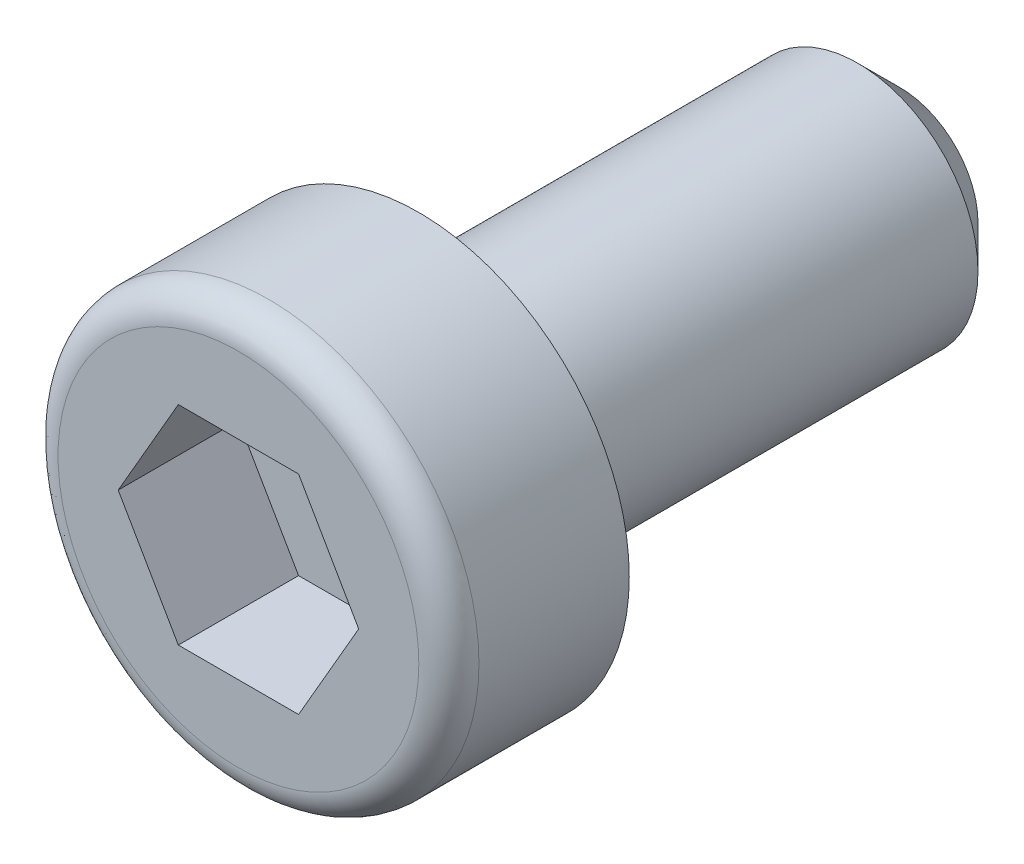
ISO-10303-21;
HEADER;
FILE_DESCRIPTION(('STEP AP214'),'2;1');
FILE_NAME('part.step','',(''),(''),'','','');
FILE_SCHEMA(('AUTOMOTIVE_DESIGN { 1 0 10303 214 1 1 1 1 }'));
ENDSEC;
DATA;
#1=APPLICATION_CONTEXT('core data for automotive mechanical design processes');
#2=APPLICATION_PROTOCOL_DEFINITION('international standard','automotive_design',2000,#1);
#3=PRODUCT_CONTEXT('',#1,'mechanical');
#4=PRODUCT('Part','Part','',(#3));
#5=PRODUCT_RELATED_PRODUCT_CATEGORY('part','',(#4));
#6=PRODUCT_DEFINITION_FORMATION('','',#4);
#7=PRODUCT_DEFINITION_CONTEXT('part definition',#1,'design');
#8=PRODUCT_DEFINITION('design','',#6,#7);
#9=PRODUCT_DEFINITION_SHAPE('','',#8);
#10=(LENGTH_UNIT() NAMED_UNIT(*) SI_UNIT(.MILLI.,.METRE.));
#11=(NAMED_UNIT(*) PLANE_ANGLE_UNIT() SI_UNIT($,.RADIAN.));
#12=(NAMED_UNIT(*) SI_UNIT($,.STERADIAN.) SOLID_ANGLE_UNIT());
#13=UNCERTAINTY_MEASURE_WITH_UNIT(LENGTH_MEASURE(1.E-05),#10,'distance_accuracy_value','');
#14=(GEOMETRIC_REPRESENTATION_CONTEXT(3) GLOBAL_UNCERTAINTY_ASSIGNED_CONTEXT((#13)) GLOBAL_UNIT_ASSIGNED_CONTEXT((#10,
#11,#12)) REPRESENTATION_CONTEXT('',''));
#15=CARTESIAN_POINT('',(0.,0.,0.));
#16=DIRECTION('',(0.,0.,1.));
#17=DIRECTION('',(1.,0.,0.));
#18=AXIS2_PLACEMENT_3D('',#15,#16,#17);
#19=CARTESIAN_POINT('',(2.,-1.7320508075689,1.));
#20=DIRECTION('',(0.,0.,-1.));
#21=DIRECTION('',(-1.,0.,0.));
#22=AXIS2_PLACEMENT_3D('',#19,#20,#21);
#23=PLANE('',#22);
#24=DIRECTION('',(-0.499999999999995,0.866025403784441,0.));
#25=VECTOR('',#24,1.);
#26=CARTESIAN_POINT('',(1.5,0.86602540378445,1.));
#27=LINE('',#26,#25);
#28=CARTESIAN_POINT('',(1.99999999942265,9.99990360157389E-10,1.));
#29=VERTEX_POINT('',#28);
#30=CARTESIAN_POINT('',(1.,1.73205080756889,1.));
#31=VERTEX_POINT('',#30);
#32=EDGE_CURVE('E76',#29,#31,#27,.T.);
#33=ORIENTED_EDGE('',*,*,#32,.T.);
#34=DIRECTION('',(-1.,0.,0.));
#35=VECTOR('',#34,1.);
#36=CARTESIAN_POINT('',(0.,1.7320508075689,1.));
#37=LINE('',#36,#35);
#38=CARTESIAN_POINT('',(-1.,1.73205080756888,1.));
#39=VERTEX_POINT('',#38);
#40=EDGE_CURVE('E105',#31,#39,#37,.T.);
#41=ORIENTED_EDGE('',*,*,#40,.T.);
#42=DIRECTION('',(-0.499999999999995,-0.866025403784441,0.));
#43=VECTOR('',#42,1.);
#44=CARTESIAN_POINT('',(-1.5,0.86602540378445,1.));
#45=LINE('',#44,#43);
#46=CARTESIAN_POINT('',(-1.99999999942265,-1.00000987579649E-09,1.));
#47=VERTEX_POINT('',#46);
#48=EDGE_CURVE('E59',#39,#47,#45,.T.);
#49=ORIENTED_EDGE('',*,*,#48,.T.);
#50=DIRECTION('',(0.499999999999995,-0.866025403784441,0.));
#51=VECTOR('',#50,1.);
#52=CARTESIAN_POINT('',(-1.5,-0.86602540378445,1.));
#53=LINE('',#52,#51);
#54=CARTESIAN_POINT('',(-1.,-1.7320508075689,1.));
#55=VERTEX_POINT('',#54);
#56=EDGE_CURVE('E100',#47,#55,#53,.T.);
#57=ORIENTED_EDGE('',*,*,#56,.T.);
#58=DIRECTION('',(1.,0.,0.));
#59=VECTOR('',#58,1.);
#60=CARTESIAN_POINT('',(0.,-1.7320508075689,1.));
#61=LINE('',#60,#59);
#62=CARTESIAN_POINT('',(1.,-1.7320508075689,1.));
#63=VERTEX_POINT('',#62);
#64=EDGE_CURVE('E92',#55,#63,#61,.T.);
#65=ORIENTED_EDGE('',*,*,#64,.T.);
#66=DIRECTION('',(0.499999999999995,0.866025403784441,0.));
#67=VECTOR('',#66,1.);
#68=CARTESIAN_POINT('',(1.5,-0.86602540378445,1.));
#69=LINE('',#68,#67);
#70=EDGE_CURVE('E85',#63,#29,#69,.T.);
#71=ORIENTED_EDGE('',*,*,#70,.T.);
#72=EDGE_LOOP('',(#33,#41,#49,#57,#65,#71));
#73=FACE_BOUND('',#72,.T.);
#74=ADVANCED_FACE('F15',(#73),#23,.F.);
#75=CARTESIAN_POINT('',(2.,0.,3.));
#76=DIRECTION('',(0.866025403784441,0.499999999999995,0.));
#77=DIRECTION('',(0.,0.,-1.));
#78=AXIS2_PLACEMENT_3D('',#75,#76,#77);
#79=PLANE('',#78);
#80=DIRECTION('',(0.,0.,-1.));
#81=VECTOR('',#80,1.);
#82=CARTESIAN_POINT('',(1.,1.7320508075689,2.));
#83=LINE('',#82,#81);
#84=CARTESIAN_POINT('',(1.00000000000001,1.73205080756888,3.));
#85=VERTEX_POINT('',#84);
#86=EDGE_CURVE('E53',#85,#31,#83,.T.);
#87=ORIENTED_EDGE('',*,*,#86,.T.);
#88=ORIENTED_EDGE('',*,*,#32,.F.);
#89=DIRECTION('',(0.,0.,1.));
#90=VECTOR('',#89,1.);
#91=CARTESIAN_POINT('',(2.,0.,2.));
#92=LINE('',#91,#90);
#93=CARTESIAN_POINT('',(1.99999999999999,0.,3.));
#94=VERTEX_POINT('',#93);
#95=EDGE_CURVE('E80',#29,#94,#92,.T.);
#96=ORIENTED_EDGE('',*,*,#95,.T.);
#97=DIRECTION('',(0.499999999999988,-0.866025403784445,0.));
#98=VECTOR('',#97,1.);
#99=CARTESIAN_POINT('',(1.00000000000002,1.73205080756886,3.));
#100=LINE('',#99,#98);
#101=EDGE_CURVE('E19',#85,#94,#100,.T.);
#102=ORIENTED_EDGE('',*,*,#101,.F.);
#103=EDGE_LOOP('',(#87,#88,#96,#102));
#104=FACE_BOUND('',#103,.T.);
#105=ADVANCED_FACE('F78',(#104),#79,.F.);
#106=CARTESIAN_POINT('',(1.,-1.7320508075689,3.));
#107=DIRECTION('',(0.866025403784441,-0.499999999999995,0.));
#108=DIRECTION('',(0.,0.,-1.));
#109=AXIS2_PLACEMENT_3D('',#106,#107,#108);
#110=PLANE('',#109);
#111=ORIENTED_EDGE('',*,*,#95,.F.);
#112=ORIENTED_EDGE('',*,*,#70,.F.);
#113=DIRECTION('',(0.,0.,1.));
#114=VECTOR('',#113,1.);
#115=CARTESIAN_POINT('',(1.,-1.7320508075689,2.));
#116=LINE('',#115,#114);
#117=CARTESIAN_POINT('',(1.00000000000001,-1.73205080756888,3.));
#118=VERTEX_POINT('',#117);
#119=EDGE_CURVE('E99',#63,#118,#116,.T.);
#120=ORIENTED_EDGE('',*,*,#119,.T.);
#121=DIRECTION('',(-0.499999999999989,-0.866025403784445,0.));
#122=VECTOR('',#121,1.);
#123=CARTESIAN_POINT('',(1.99999999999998,0.,3.));
#124=LINE('',#123,#122);
#125=EDGE_CURVE('E91',#94,#118,#124,.T.);
#126=ORIENTED_EDGE('',*,*,#125,.F.);
#127=EDGE_LOOP('',(#111,#112,#120,#126));
#128=FACE_BOUND('',#127,.T.);
#129=ADVANCED_FACE('F88',(#128),#110,.F.);
#130=CARTESIAN_POINT('',(-1.,-1.7320508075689,3.));
#131=DIRECTION('',(0.,-1.,0.));
#132=DIRECTION('',(0.,0.,-1.));
#133=AXIS2_PLACEMENT_3D('',#130,#131,#132);
#134=PLANE('',#133);
#135=ORIENTED_EDGE('',*,*,#119,.F.);
#136=ORIENTED_EDGE('',*,*,#64,.F.);
#137=DIRECTION('',(0.,0.,1.));
#138=VECTOR('',#137,1.);
#139=CARTESIAN_POINT('',(-1.,-1.7320508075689,2.));
#140=LINE('',#139,#138);
#141=CARTESIAN_POINT('',(-1.00000000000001,-1.73205080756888,3.));
#142=VERTEX_POINT('',#141);
#143=EDGE_CURVE('E102',#55,#142,#140,.T.);
#144=ORIENTED_EDGE('',*,*,#143,.T.);
#145=DIRECTION('',(-1.,0.,0.));
#146=VECTOR('',#145,1.);
#147=CARTESIAN_POINT('',(0.,-1.73205080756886,3.));
#148=LINE('',#147,#146);
#149=EDGE_CURVE('E204',#118,#142,#148,.T.);
#150=ORIENTED_EDGE('',*,*,#149,.F.);
#151=EDGE_LOOP('',(#135,#136,#144,#150));
#152=FACE_BOUND('',#151,.T.);
#153=ADVANCED_FACE('F185',(#152),#134,.F.);
#154=CARTESIAN_POINT('',(-2.,0.,3.));
#155=DIRECTION('',(-0.866025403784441,-0.499999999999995,0.));
#156=DIRECTION('',(0.,0.,-1.));
#157=AXIS2_PLACEMENT_3D('',#154,#155,#156);
#158=PLANE('',#157);
#159=ORIENTED_EDGE('',*,*,#143,.F.);
#160=ORIENTED_EDGE('',*,*,#56,.F.);
#161=DIRECTION('',(0.,0.,1.));
#162=VECTOR('',#161,1.);
#163=CARTESIAN_POINT('',(-2.,0.,2.));
#164=LINE('',#163,#162);
#165=CARTESIAN_POINT('',(-1.99999999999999,0.,3.));
#166=VERTEX_POINT('',#165);
#167=EDGE_CURVE('E104',#47,#166,#164,.T.);
#168=ORIENTED_EDGE('',*,*,#167,.T.);
#169=DIRECTION('',(-0.499999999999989,0.866025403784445,0.));
#170=VECTOR('',#169,1.);
#171=CARTESIAN_POINT('',(-1.00000000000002,-1.73205080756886,3.));
#172=LINE('',#171,#170);
#173=EDGE_CURVE('E206',#142,#166,#172,.T.);
#174=ORIENTED_EDGE('',*,*,#173,.F.);
#175=EDGE_LOOP('',(#159,#160,#168,#174));
#176=FACE_BOUND('',#175,.T.);
#177=ADVANCED_FACE('F188',(#176),#158,.F.);
#178=CARTESIAN_POINT('',(-1.,1.7320508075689,3.));
#179=DIRECTION('',(-0.866025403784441,0.499999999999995,0.));
#180=DIRECTION('',(0.,0.,-1.));
#181=AXIS2_PLACEMENT_3D('',#178,#179,#180);
#182=PLANE('',#181);
#183=ORIENTED_EDGE('',*,*,#167,.F.);
#184=ORIENTED_EDGE('',*,*,#48,.F.);
#185=DIRECTION('',(0.,0.,1.));
#186=VECTOR('',#185,1.);
#187=CARTESIAN_POINT('',(-1.,1.7320508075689,2.));
#188=LINE('',#187,#186);
#189=CARTESIAN_POINT('',(-1.00000000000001,1.73205080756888,3.));
#190=VERTEX_POINT('',#189);
#191=EDGE_CURVE('E107',#39,#190,#188,.T.);
#192=ORIENTED_EDGE('',*,*,#191,.T.);
#193=DIRECTION('',(0.499999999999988,0.866025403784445,0.));
#194=VECTOR('',#193,1.);
#195=CARTESIAN_POINT('',(-1.99999999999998,0.,3.));
#196=LINE('',#195,#194);
#197=EDGE_CURVE('E34',#166,#190,#196,.T.);
#198=ORIENTED_EDGE('',*,*,#197,.F.);
#199=EDGE_LOOP('',(#183,#184,#192,#198));
#200=FACE_BOUND('',#199,.T.);
#201=ADVANCED_FACE('F191',(#200),#182,.F.);
#202=CARTESIAN_POINT('',(1.,1.7320508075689,3.));
#203=DIRECTION('',(0.,1.,0.));
#204=DIRECTION('',(0.,0.,-1.));
#205=AXIS2_PLACEMENT_3D('',#202,#203,#204);
#206=PLANE('',#205);
#207=ORIENTED_EDGE('',*,*,#191,.F.);
#208=ORIENTED_EDGE('',*,*,#40,.F.);
#209=ORIENTED_EDGE('',*,*,#86,.F.);
#210=DIRECTION('',(1.,0.,0.));
#211=VECTOR('',#210,1.);
#212=CARTESIAN_POINT('',(0.,1.73205080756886,3.));
#213=LINE('',#212,#211);
#214=EDGE_CURVE('E199',#190,#85,#213,.T.);
#215=ORIENTED_EDGE('',*,*,#214,.F.);
#216=EDGE_LOOP('',(#207,#208,#209,#215));
#217=FACE_BOUND('',#216,.T.);
#218=ADVANCED_FACE('F157',(#217),#206,.F.);
#219=CARTESIAN_POINT('',(-3.,-3.,3.));
#220=DIRECTION('',(0.,0.,1.));
#221=DIRECTION('',(1.,0.,0.));
#222=AXIS2_PLACEMENT_3D('',#219,#220,#221);
#223=PLANE('',#222);
#224=ORIENTED_EDGE('',*,*,#197,.T.);
#225=ORIENTED_EDGE('',*,*,#214,.T.);
#226=ORIENTED_EDGE('',*,*,#101,.T.);
#227=ORIENTED_EDGE('',*,*,#125,.T.);
#228=ORIENTED_EDGE('',*,*,#149,.T.);
#229=ORIENTED_EDGE('',*,*,#173,.T.);
#230=EDGE_LOOP('',(#224,#225,#226,#227,#228,#229));
#231=FACE_BOUND('',#230,.T.);
#232=CARTESIAN_POINT('',(0.,0.,3.));
#233=DIRECTION('',(0.,0.,-1.));
#234=DIRECTION('',(1.,0.,0.));
#235=AXIS2_PLACEMENT_3D('',#232,#233,#234);
#236=CIRCLE('',#235,3.);
#237=CARTESIAN_POINT('',(3.,0.,3.));
#238=VERTEX_POINT('',#237);
#239=EDGE_CURVE('E143',#238,#238,#236,.T.);
#240=ORIENTED_EDGE('',*,*,#239,.F.);
#241=EDGE_LOOP('',(#240));
#242=FACE_BOUND('',#241,.T.);
#243=ADVANCED_FACE('F123',(#231,#242),#223,.T.);
#244=CARTESIAN_POINT('',(3.,0.,3.));
#245=CARTESIAN_POINT('',(3.5,0.,3.));
#246=CARTESIAN_POINT('',(3.5,0.,2.5));
#247=CARTESIAN_POINT('',(3.5,0.,2.));
#248=CARTESIAN_POINT('',(3.,0.,2.));
#249=(BOUNDED_CURVE() B_SPLINE_CURVE(2,(#244,#245,#246,#247,#248),.UNSPECIFIED.,.F.,
.F.) B_SPLINE_CURVE_WITH_KNOTS((3,2,3),(0.,0.25,0.5),
.UNSPECIFIED.) CURVE() GEOMETRIC_REPRESENTATION_ITEM() RATIONAL_B_SPLINE_CURVE((1.,
0.70710678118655,1.,0.70710678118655,1.)) REPRESENTATION_ITEM(''));
#250=CARTESIAN_POINT('',(0.,0.,2.));
#251=DIRECTION('',(0.,0.,1.));
#252=AXIS1_PLACEMENT('',#250,#251);
#253=SURFACE_OF_REVOLUTION('',#249,#252);
#254=CARTESIAN_POINT('',(0.,0.,2.5));
#255=DIRECTION('',(0.,0.,1.));
#256=DIRECTION('',(1.,0.,0.));
#257=AXIS2_PLACEMENT_3D('',#254,#255,#256);
#258=CIRCLE('',#257,3.5);
#259=CARTESIAN_POINT('',(3.5,0.,2.5));
#260=VERTEX_POINT('',#259);
#261=EDGE_CURVE('E217',#260,#260,#258,.T.);
#262=ORIENTED_EDGE('',*,*,#261,.T.);
#263=EDGE_LOOP('',(#262));
#264=FACE_BOUND('',#263,.T.);
#265=ORIENTED_EDGE('',*,*,#239,.T.);
#266=EDGE_LOOP('',(#265));
#267=FACE_BOUND('',#266,.T.);
#268=ADVANCED_FACE('F118',(#264,#267),#253,.F.);
#269=CARTESIAN_POINT('',(1.3,-1.3,-8.));
#270=DIRECTION('',(0.,0.,-1.));
#271=DIRECTION('',(-1.,0.,0.));
#272=AXIS2_PLACEMENT_3D('',#269,#270,#271);
#273=PLANE('',#272);
#274=CARTESIAN_POINT('',(0.,0.,-8.));
#275=DIRECTION('',(0.,0.,1.));
#276=DIRECTION('',(1.,0.,0.));
#277=AXIS2_PLACEMENT_3D('',#274,#275,#276);
#278=CIRCLE('',#277,1.3);
#279=CARTESIAN_POINT('',(1.3,0.,-8.));
#280=VERTEX_POINT('',#279);
#281=EDGE_CURVE('E213',#280,#280,#278,.F.);
#282=ORIENTED_EDGE('',*,*,#281,.T.);
#283=EDGE_LOOP('',(#282));
#284=FACE_BOUND('',#283,.T.);
#285=ADVANCED_FACE('F122',(#284),#273,.T.);
#286=CARTESIAN_POINT('',(0.,0.,0.));
#287=DIRECTION('',(0.,0.,1.));
#288=DIRECTION('',(1.,0.,0.));
#289=AXIS2_PLACEMENT_3D('',#286,#287,#288);
#290=CYLINDRICAL_SURFACE('',#289,3.5);
#291=CARTESIAN_POINT('',(0.,0.,0.));
#292=DIRECTION('',(0.,0.,1.));
#293=DIRECTION('',(1.,0.,0.));
#294=AXIS2_PLACEMENT_3D('',#291,#292,#293);
#295=CIRCLE('',#294,3.5);
#296=CARTESIAN_POINT('',(3.5,0.,0.));
#297=VERTEX_POINT('',#296);
#298=EDGE_CURVE('E137',#297,#297,#295,.F.);
#299=ORIENTED_EDGE('',*,*,#298,.F.);
#300=EDGE_LOOP('',(#299));
#301=FACE_BOUND('',#300,.T.);
#302=ORIENTED_EDGE('',*,*,#261,.F.);
#303=EDGE_LOOP('',(#302));
#304=FACE_BOUND('',#303,.T.);
#305=ADVANCED_FACE('F125',(#301,#304),#290,.T.);
#306=CARTESIAN_POINT('',(0.,0.,-8.));
#307=DIRECTION('',(0.,0.,1.));
#308=DIRECTION('',(1.,0.,0.));
#309=AXIS2_PLACEMENT_3D('',#306,#307,#308);
#310=CONICAL_SURFACE('',#309,1.3,0.785398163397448);
#311=ORIENTED_EDGE('',*,*,#281,.F.);
#312=EDGE_LOOP('',(#311));
#313=FACE_BOUND('',#312,.T.);
#314=CARTESIAN_POINT('',(0.,0.,-7.3));
#315=DIRECTION('',(0.,0.,1.));
#316=DIRECTION('',(1.,0.,0.));
#317=AXIS2_PLACEMENT_3D('',#314,#315,#316);
#318=CIRCLE('',#317,2.);
#319=CARTESIAN_POINT('',(2.,0.,-7.3));
#320=VERTEX_POINT('',#319);
#321=EDGE_CURVE('E25',#320,#320,#318,.F.);
#322=ORIENTED_EDGE('',*,*,#321,.T.);
#323=EDGE_LOOP('',(#322));
#324=FACE_BOUND('',#323,.T.);
#325=ADVANCED_FACE('F165',(#313,#324),#310,.T.);
#326=CARTESIAN_POINT('',(3.5,-3.5,0.));
#327=DIRECTION('',(0.,0.,-1.));
#328=DIRECTION('',(-1.,0.,0.));
#329=AXIS2_PLACEMENT_3D('',#326,#327,#328);
#330=PLANE('',#329);
#331=CARTESIAN_POINT('',(0.,0.,0.));
#332=DIRECTION('',(0.,0.,1.));
#333=DIRECTION('',(1.,0.,0.));
#334=AXIS2_PLACEMENT_3D('',#331,#332,#333);
#335=CIRCLE('',#334,2.);
#336=CARTESIAN_POINT('',(2.,0.,0.));
#337=VERTEX_POINT('',#336);
#338=EDGE_CURVE('E10',#337,#337,#335,.T.);
#339=ORIENTED_EDGE('',*,*,#338,.T.);
#340=EDGE_LOOP('',(#339));
#341=FACE_BOUND('',#340,.T.);
#342=ORIENTED_EDGE('',*,*,#298,.T.);
#343=EDGE_LOOP('',(#342));
#344=FACE_BOUND('',#343,.T.);
#345=ADVANCED_FACE('F17',(#341,#344),#330,.T.);
#346=CARTESIAN_POINT('',(0.,0.,-7.3));
#347=DIRECTION('',(0.,0.,1.));
#348=DIRECTION('',(1.,0.,0.));
#349=AXIS2_PLACEMENT_3D('',#346,#347,#348);
#350=CYLINDRICAL_SURFACE('',#349,2.);
#351=ORIENTED_EDGE('',*,*,#321,.F.);
#352=EDGE_LOOP('',(#351));
#353=FACE_BOUND('',#352,.T.);
#354=ORIENTED_EDGE('',*,*,#338,.F.);
#355=EDGE_LOOP('',(#354));
#356=FACE_BOUND('',#355,.T.);
#357=ADVANCED_FACE('F168',(#353,#356),#350,.T.);
#358=CLOSED_SHELL('',(#74,#105,#129,#153,#177,#201,#218,#243,#268,#285,#305,#325,#345,#357));
#359=MANIFOLD_SOLID_BREP('B1',#358);
#360=ADVANCED_BREP_SHAPE_REPRESENTATION('',(#18,#359),#14);
#361=SHAPE_DEFINITION_REPRESENTATION(#9,#360);
ENDSEC;
END-ISO-10303-21;
